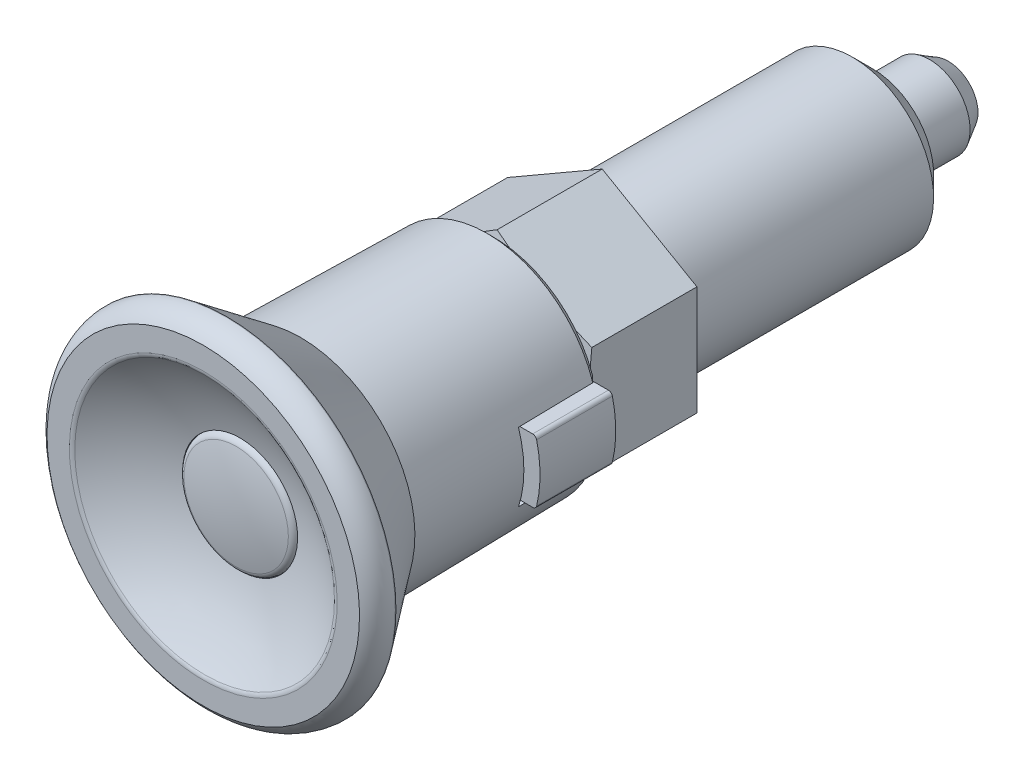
ISO-10303-21;
HEADER;
FILE_DESCRIPTION(('STEP AP214'),'2;1');
FILE_NAME('part.step','',(''),(''),'','','');
FILE_SCHEMA(('AUTOMOTIVE_DESIGN { 1 0 10303 214 1 1 1 1 }'));
ENDSEC;
DATA;
#1=APPLICATION_CONTEXT('core data for automotive mechanical design processes');
#2=APPLICATION_PROTOCOL_DEFINITION('international standard','automotive_design',2000,#1);
#3=PRODUCT_CONTEXT('',#1,'mechanical');
#4=PRODUCT('Part','Part','',(#3));
#5=PRODUCT_RELATED_PRODUCT_CATEGORY('part','',(#4));
#6=PRODUCT_DEFINITION_FORMATION('','',#4);
#7=PRODUCT_DEFINITION_CONTEXT('part definition',#1,'design');
#8=PRODUCT_DEFINITION('design','',#6,#7);
#9=PRODUCT_DEFINITION_SHAPE('','',#8);
#10=(LENGTH_UNIT() NAMED_UNIT(*) SI_UNIT(.MILLI.,.METRE.));
#11=(NAMED_UNIT(*) PLANE_ANGLE_UNIT() SI_UNIT($,.RADIAN.));
#12=(NAMED_UNIT(*) SI_UNIT($,.STERADIAN.) SOLID_ANGLE_UNIT());
#13=UNCERTAINTY_MEASURE_WITH_UNIT(LENGTH_MEASURE(1.E-05),#10,'distance_accuracy_value','');
#14=(GEOMETRIC_REPRESENTATION_CONTEXT(3) GLOBAL_UNCERTAINTY_ASSIGNED_CONTEXT((#13)) GLOBAL_UNIT_ASSIGNED_CONTEXT((#10,
#11,#12)) REPRESENTATION_CONTEXT('',''));
#15=CARTESIAN_POINT('',(0.,0.,0.));
#16=DIRECTION('',(0.,0.,1.));
#17=DIRECTION('',(1.,0.,0.));
#18=AXIS2_PLACEMENT_3D('',#15,#16,#17);
#19=CARTESIAN_POINT('',(6.,-3.05,14.1));
#20=DIRECTION('',(0.,0.,1.));
#21=DIRECTION('',(0.,-1.,0.));
#22=AXIS2_PLACEMENT_3D('',#19,#20,#21);
#23=PLANE('',#22);
#24=DIRECTION('',(0.,-1.,0.));
#25=VECTOR('',#24,1.);
#26=CARTESIAN_POINT('',(6.5,3.05,14.1));
#27=LINE('',#26,#25);
#28=CARTESIAN_POINT('',(6.5,2.55,14.1));
#29=VERTEX_POINT('',#28);
#30=CARTESIAN_POINT('',(6.5,-2.55,14.1));
#31=VERTEX_POINT('',#30);
#32=EDGE_CURVE('E165',#29,#31,#27,.T.);
#33=ORIENTED_EDGE('',*,*,#32,.F.);
#34=DIRECTION('',(-1.,0.,0.));
#35=VECTOR('',#34,1.);
#36=CARTESIAN_POINT('',(12.5,2.55,14.1));
#37=LINE('',#36,#35);
#38=CARTESIAN_POINT('',(7.90538056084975,2.55,14.1));
#39=VERTEX_POINT('',#38);
#40=EDGE_CURVE('E190',#39,#29,#37,.T.);
#41=ORIENTED_EDGE('',*,*,#40,.F.);
#42=CARTESIAN_POINT('',(0.,0.,14.1));
#43=DIRECTION('',(0.,0.,1.));
#44=DIRECTION('',(0.,-1.,0.));
#45=AXIS2_PLACEMENT_3D('',#42,#43,#44);
#46=CIRCLE('',#45,8.30647589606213);
#47=CARTESIAN_POINT('',(7.90538056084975,-2.55,14.1));
#48=VERTEX_POINT('',#47);
#49=EDGE_CURVE('E313',#48,#39,#46,.T.);
#50=ORIENTED_EDGE('',*,*,#49,.F.);
#51=DIRECTION('',(1.,0.,0.));
#52=VECTOR('',#51,1.);
#53=CARTESIAN_POINT('',(6.5,-2.55,14.1));
#54=LINE('',#53,#52);
#55=EDGE_CURVE('E188',#31,#48,#54,.T.);
#56=ORIENTED_EDGE('',*,*,#55,.F.);
#57=EDGE_LOOP('',(#33,#41,#50,#56));
#58=FACE_BOUND('',#57,.T.);
#59=ADVANCED_FACE('F14',(#58),#23,.F.);
#60=CARTESIAN_POINT('',(0.,0.,8.));
#61=DIRECTION('',(0.,0.,-1.));
#62=DIRECTION('',(0.,1.,0.));
#63=AXIS2_PLACEMENT_3D('',#60,#61,#62);
#64=PLANE('',#63);
#65=DIRECTION('',(0.,1.,0.));
#66=VECTOR('',#65,1.);
#67=CARTESIAN_POINT('',(6.5,3.05,8.));
#68=LINE('',#67,#66);
#69=CARTESIAN_POINT('',(6.5,-2.55,8.));
#70=VERTEX_POINT('',#69);
#71=CARTESIAN_POINT('',(6.5,2.55,8.));
#72=VERTEX_POINT('',#71);
#73=EDGE_CURVE('E163',#70,#72,#68,.T.);
#74=ORIENTED_EDGE('',*,*,#73,.F.);
#75=DIRECTION('',(1.,0.,0.));
#76=VECTOR('',#75,1.);
#77=CARTESIAN_POINT('',(6.5,-2.55,8.));
#78=LINE('',#77,#76);
#79=CARTESIAN_POINT('',(6.51901066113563,-2.55,8.));
#80=VERTEX_POINT('',#79);
#81=EDGE_CURVE('E177',#70,#80,#78,.T.);
#82=ORIENTED_EDGE('',*,*,#81,.T.);
#83=CARTESIAN_POINT('',(0.,0.,8.));
#84=DIRECTION('',(0.,0.,-1.));
#85=DIRECTION('',(0.,1.,0.));
#86=AXIS2_PLACEMENT_3D('',#83,#84,#85);
#87=CIRCLE('',#86,7.);
#88=CARTESIAN_POINT('',(7.,0.,8.));
#89=VERTEX_POINT('',#88);
#90=EDGE_CURVE('E192',#89,#80,#87,.T.);
#91=ORIENTED_EDGE('',*,*,#90,.F.);
#92=CARTESIAN_POINT('',(6.51901066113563,2.55,8.));
#93=VERTEX_POINT('',#92);
#94=EDGE_CURVE('E407',#93,#89,#87,.T.);
#95=ORIENTED_EDGE('',*,*,#94,.F.);
#96=DIRECTION('',(1.,0.,0.));
#97=VECTOR('',#96,1.);
#98=CARTESIAN_POINT('',(7.7,2.55,8.));
#99=LINE('',#98,#97);
#100=EDGE_CURVE('E181',#72,#93,#99,.T.);
#101=ORIENTED_EDGE('',*,*,#100,.F.);
#102=EDGE_LOOP('',(#74,#82,#91,#95,#101));
#103=FACE_BOUND('',#102,.T.);
#104=ADVANCED_FACE('F175',(#103),#64,.F.);
#105=CARTESIAN_POINT('',(5.9,-2.95,13.8));
#106=DIRECTION('',(0.,0.,1.));
#107=DIRECTION('',(0.,-1.,0.));
#108=AXIS2_PLACEMENT_3D('',#105,#106,#107);
#109=PLANE('',#108);
#110=DIRECTION('',(-1.,0.,0.));
#111=VECTOR('',#110,1.);
#112=CARTESIAN_POINT('',(8.65789109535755,2.35,13.8));
#113=LINE('',#112,#111);
#114=CARTESIAN_POINT('',(8.65789109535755,2.35,13.8));
#115=VERTEX_POINT('',#114);
#116=CARTESIAN_POINT('',(6.5,2.35,13.8));
#117=VERTEX_POINT('',#116);
#118=EDGE_CURVE('E545',#115,#117,#113,.T.);
#119=ORIENTED_EDGE('',*,*,#118,.T.);
#120=DIRECTION('',(0.,-1.,0.));
#121=VECTOR('',#120,1.);
#122=CARTESIAN_POINT('',(6.5,-2.95,13.8));
#123=LINE('',#122,#121);
#124=CARTESIAN_POINT('',(6.5,-2.35,13.8));
#125=VERTEX_POINT('',#124);
#126=EDGE_CURVE('E182',#117,#125,#123,.T.);
#127=ORIENTED_EDGE('',*,*,#126,.T.);
#128=DIRECTION('',(1.,0.,0.));
#129=VECTOR('',#128,1.);
#130=CARTESIAN_POINT('',(6.5,-2.35,13.8));
#131=LINE('',#130,#129);
#132=CARTESIAN_POINT('',(8.65789109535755,-2.35,13.8));
#133=VERTEX_POINT('',#132);
#134=EDGE_CURVE('E568',#125,#133,#131,.T.);
#135=ORIENTED_EDGE('',*,*,#134,.T.);
#136=CARTESIAN_POINT('',(8.65789109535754,-2.05,13.8));
#137=DIRECTION('',(0.,0.,1.));
#138=DIRECTION('',(1.,0.,0.));
#139=AXIS2_PLACEMENT_3D('',#136,#137,#138);
#140=CIRCLE('',#139,0.3);
#141=CARTESIAN_POINT('',(8.94963738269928,-2.11988636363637,13.8));
#142=VERTEX_POINT('',#141);
#143=EDGE_CURVE('E570',#133,#142,#140,.T.);
#144=ORIENTED_EDGE('',*,*,#143,.T.);
#145=CARTESIAN_POINT('',(0.100000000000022,0.,13.8));
#146=DIRECTION('',(0.,0.,1.));
#147=DIRECTION('',(1.,0.,0.));
#148=AXIS2_PLACEMENT_3D('',#145,#146,#147);
#149=CIRCLE('',#148,9.1);
#150=CARTESIAN_POINT('',(8.94963738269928,2.11988636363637,13.8));
#151=VERTEX_POINT('',#150);
#152=EDGE_CURVE('E572',#142,#151,#149,.T.);
#153=ORIENTED_EDGE('',*,*,#152,.T.);
#154=CARTESIAN_POINT('',(8.65789109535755,2.05,13.8));
#155=DIRECTION('',(0.,0.,1.));
#156=DIRECTION('',(1.,0.,0.));
#157=AXIS2_PLACEMENT_3D('',#154,#155,#156);
#158=CIRCLE('',#157,0.3);
#159=EDGE_CURVE('E549',#151,#115,#158,.T.);
#160=ORIENTED_EDGE('',*,*,#159,.T.);
#161=EDGE_LOOP('',(#119,#127,#135,#144,#153,#160));
#162=FACE_BOUND('',#161,.T.);
#163=ADVANCED_FACE('F277',(#162),#109,.T.);
#164=CARTESIAN_POINT('',(5.9,-2.95,8.2));
#165=DIRECTION('',(0.,0.,1.));
#166=DIRECTION('',(0.,-1.,0.));
#167=AXIS2_PLACEMENT_3D('',#164,#165,#166);
#168=PLANE('',#167);
#169=DIRECTION('',(0.,-1.,0.));
#170=VECTOR('',#169,1.);
#171=CARTESIAN_POINT('',(6.5,-2.95,8.2));
#172=LINE('',#171,#170);
#173=CARTESIAN_POINT('',(6.5,2.35,8.2));
#174=VERTEX_POINT('',#173);
#175=CARTESIAN_POINT('',(6.5,-2.35,8.2));
#176=VERTEX_POINT('',#175);
#177=EDGE_CURVE('E9',#174,#176,#172,.T.);
#178=ORIENTED_EDGE('',*,*,#177,.F.);
#179=DIRECTION('',(-1.,0.,0.));
#180=VECTOR('',#179,1.);
#181=CARTESIAN_POINT('',(8.65789109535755,2.35,8.2));
#182=LINE('',#181,#180);
#183=CARTESIAN_POINT('',(8.65789109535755,2.35,8.2));
#184=VERTEX_POINT('',#183);
#185=EDGE_CURVE('E557',#184,#174,#182,.T.);
#186=ORIENTED_EDGE('',*,*,#185,.F.);
#187=CARTESIAN_POINT('',(8.65789109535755,2.05,8.2));
#188=DIRECTION('',(0.,0.,1.));
#189=DIRECTION('',(1.,0.,0.));
#190=AXIS2_PLACEMENT_3D('',#187,#188,#189);
#191=CIRCLE('',#190,0.3);
#192=CARTESIAN_POINT('',(8.94963738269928,2.11988636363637,8.2));
#193=VERTEX_POINT('',#192);
#194=EDGE_CURVE('E578',#193,#184,#191,.T.);
#195=ORIENTED_EDGE('',*,*,#194,.F.);
#196=CARTESIAN_POINT('',(0.100000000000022,0.,8.2));
#197=DIRECTION('',(0.,0.,1.));
#198=DIRECTION('',(1.,0.,0.));
#199=AXIS2_PLACEMENT_3D('',#196,#197,#198);
#200=CIRCLE('',#199,9.1);
#201=CARTESIAN_POINT('',(8.94963738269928,-2.11988636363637,8.2));
#202=VERTEX_POINT('',#201);
#203=EDGE_CURVE('E576',#202,#193,#200,.T.);
#204=ORIENTED_EDGE('',*,*,#203,.F.);
#205=CARTESIAN_POINT('',(8.65789109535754,-2.05,8.2));
#206=DIRECTION('',(0.,0.,1.));
#207=DIRECTION('',(1.,0.,0.));
#208=AXIS2_PLACEMENT_3D('',#205,#206,#207);
#209=CIRCLE('',#208,0.3);
#210=CARTESIAN_POINT('',(8.65789109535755,-2.35,8.2));
#211=VERTEX_POINT('',#210);
#212=EDGE_CURVE('E565',#211,#202,#209,.T.);
#213=ORIENTED_EDGE('',*,*,#212,.F.);
#214=DIRECTION('',(1.,0.,0.));
#215=VECTOR('',#214,1.);
#216=CARTESIAN_POINT('',(6.5,-2.35,8.2));
#217=LINE('',#216,#215);
#218=EDGE_CURVE('E563',#176,#211,#217,.T.);
#219=ORIENTED_EDGE('',*,*,#218,.F.);
#220=EDGE_LOOP('',(#178,#186,#195,#204,#213,#219));
#221=FACE_BOUND('',#220,.T.);
#222=ADVANCED_FACE('F535',(#221),#168,.F.);
#223=CARTESIAN_POINT('',(0.,0.,42.2));
#224=DIRECTION('',(0.,0.,-1.));
#225=DIRECTION('',(-1.,0.,0.));
#226=AXIS2_PLACEMENT_3D('',#223,#224,#225);
#227=SPHERICAL_SURFACE('',#226,16.);
#228=CARTESIAN_POINT('',(0.,0.,29.4));
#229=DIRECTION('',(0.,0.,-1.));
#230=DIRECTION('',(0.,1.,0.));
#231=AXIS2_PLACEMENT_3D('',#228,#229,#230);
#232=CIRCLE('',#231,9.6);
#233=CARTESIAN_POINT('',(-9.59999999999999,0.,29.4));
#234=VERTEX_POINT('',#233);
#235=EDGE_CURVE('E309',#234,#234,#232,.T.);
#236=CARTESIAN_POINT('',(0.,0.,26.7747771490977));
#237=DIRECTION('',(0.,0.,1.));
#238=DIRECTION('',(0.,-1.,0.));
#239=AXIS2_PLACEMENT_3D('',#236,#237,#238);
#240=CIRCLE('',#239,4.25);
#241=CARTESIAN_POINT('',(-4.24999999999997,0.,26.7747771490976));
#242=VERTEX_POINT('',#241);
#243=EDGE_CURVE('E607',#242,#242,#240,.T.);
#244=CARTESIAN_POINT('',(-9.59999999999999,0.,29.4));
#245=CARTESIAN_POINT('',(-9.55004681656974,0.,29.3625350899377));
#246=CARTESIAN_POINT('',(-9.49987429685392,0.,29.3253626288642));
#247=CARTESIAN_POINT('',(-9.39909750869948,0.,29.2516076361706));
#248=CARTESIAN_POINT('',(-9.34849324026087,0.,29.2150251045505));
#249=CARTESIAN_POINT('',(-9.24685987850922,0.,29.1424550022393));
#250=CARTESIAN_POINT('',(-9.19583078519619,0.,29.1064674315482));
#251=CARTESIAN_POINT('',(-9.09335477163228,0.,29.0350921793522));
#252=CARTESIAN_POINT('',(-9.0419078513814,0.,28.9997044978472));
#253=CARTESIAN_POINT('',(-8.93860323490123,0.,28.929533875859));
#254=CARTESIAN_POINT('',(-8.88674553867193,0.,28.8947509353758));
#255=CARTESIAN_POINT('',(-8.78262647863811,0.,28.8257945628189));
#256=CARTESIAN_POINT('',(-8.73036511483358,0.,28.7916211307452));
#257=CARTESIAN_POINT('',(-8.62544588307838,0.,28.7238884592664));
#258=CARTESIAN_POINT('',(-8.5727880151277,0.,28.6903292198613));
#259=CARTESIAN_POINT('',(-8.46708299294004,0.,28.6238295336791));
#260=CARTESIAN_POINT('',(-8.41403583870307,0.,28.5908890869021));
#261=CARTESIAN_POINT('',(-8.30755951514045,0.,28.5256315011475));
#262=CARTESIAN_POINT('',(-8.2541303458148,0.,28.4933143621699));
#263=CARTESIAN_POINT('',(-8.14689731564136,0.,28.4293078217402));
#264=CARTESIAN_POINT('',(-8.09309345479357,0.,28.3976184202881));
#265=CARTESIAN_POINT('',(-7.98511841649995,0.,28.3348716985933));
#266=CARTESIAN_POINT('',(-7.93094723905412,0.,28.3038143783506));
#267=CARTESIAN_POINT('',(-7.82224499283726,0.,28.2423360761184));
#268=CARTESIAN_POINT('',(-7.76771392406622,0.,28.2119150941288));
#269=CARTESIAN_POINT('',(-7.65829936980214,0.,28.1517136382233));
#270=CARTESIAN_POINT('',(-7.6034158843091,0.,28.1219331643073));
#271=CARTESIAN_POINT('',(-7.49330401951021,0.,28.0630168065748));
#272=CARTESIAN_POINT('',(-7.43807564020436,0.,28.0338809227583));
#273=CARTESIAN_POINT('',(-7.32728155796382,0.,27.9762577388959));
#274=CARTESIAN_POINT('',(-7.27171585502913,0.,27.9477704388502));
#275=CARTESIAN_POINT('',(-7.16025474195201,0.,27.8914483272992));
#276=CARTESIAN_POINT('',(-7.10435933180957,0.,27.863613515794));
#277=CARTESIAN_POINT('',(-6.9922464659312,0.,27.8086001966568));
#278=CARTESIAN_POINT('',(-6.93602901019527,0.,27.7814216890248));
#279=CARTESIAN_POINT('',(-6.82327975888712,0.,27.7277247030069));
#280=CARTESIAN_POINT('',(-6.76674796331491,0.,27.701206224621));
#281=CARTESIAN_POINT('',(-6.65337778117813,0.,27.6488329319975));
#282=CARTESIAN_POINT('',(-6.59653939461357,0.,27.6229781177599));
#283=CARTESIAN_POINT('',(-6.48256382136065,0.,27.5719356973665));
#284=CARTESIAN_POINT('',(-6.42542663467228,0.,27.5467480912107));
#285=CARTESIAN_POINT('',(-6.31086129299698,0.,27.4970435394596));
#286=CARTESIAN_POINT('',(-6.25343313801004,0.,27.4725265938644));
#287=CARTESIAN_POINT('',(-6.13829373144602,0.,27.4241667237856));
#288=CARTESIAN_POINT('',(-6.08058247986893,0.,27.400323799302));
#289=CARTESIAN_POINT('',(-5.96488479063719,0.,27.3533152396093));
#290=CARTESIAN_POINT('',(-5.90689835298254,0.,27.3301496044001));
#291=CARTESIAN_POINT('',(-5.79065823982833,0.,27.2844987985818));
#292=CARTESIAN_POINT('',(-5.73240456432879,0.,27.2620136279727));
#293=CARTESIAN_POINT('',(-5.61563796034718,0.,27.2177268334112));
#294=CARTESIAN_POINT('',(-5.55712503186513,0.,27.1959252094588));
#295=CARTESIAN_POINT('',(-5.43984794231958,0.,27.1530084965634));
#296=CARTESIAN_POINT('',(-5.38108378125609,0.,27.1318934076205));
#297=CARTESIAN_POINT('',(-5.26331228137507,0.,27.0903526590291));
#298=CARTESIAN_POINT('',(-5.20430494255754,0.,27.0699269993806));
#299=CARTESIAN_POINT('',(-5.08605517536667,0.,27.0297679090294));
#300=CARTESIAN_POINT('',(-5.02681274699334,0.,27.0100344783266));
#301=CARTESIAN_POINT('',(-4.9081009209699,0.,26.9712625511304));
#302=CARTESIAN_POINT('',(-4.84863152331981,0.,26.952224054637));
#303=CARTESIAN_POINT('',(-4.72947391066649,0.,26.9148446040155));
#304=CARTESIAN_POINT('',(-4.66978569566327,0.,26.8965036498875));
#305=CARTESIAN_POINT('',(-4.55019862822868,0.,26.8605218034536));
#306=CARTESIAN_POINT('',(-4.4902997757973,0.,26.8428809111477));
#307=CARTESIAN_POINT('',(-4.37029964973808,0.,26.8083015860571));
#308=CARTESIAN_POINT('',(-4.31019837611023,0.,26.7913631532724));
#309=CARTESIAN_POINT('',(-4.24999999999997,0.,26.7747771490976));
#310=B_SPLINE_CURVE_WITH_KNOTS('',3,(#244,#245,#246,#247,#248,#249,#250,#251,#252,#253,#254,
#255,#256,#257,#258,#259,#260,#261,#262,#263,#264,#265,#266,#267,#268,#269,#270,#271,#272,#273,
#274,#275,#276,#277,#278,#279,#280,#281,#282,#283,#284,#285,#286,#287,#288,#289,#290,#291,#292,
#293,#294,#295,#296,#297,#298,#299,#300,#301,#302,#303,#304,#305,#306,#307,#308,#309),
.UNSPECIFIED.,.F.,.F.,(4,2,2,2,2,2,2,2,2,2,2,2,2,2,2,2,2,2,2,2,2,2,2,2,2,2,2,2,2,2,2,2,4),(0.,
0.187323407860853,0.374646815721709,0.561970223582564,0.749293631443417,0.936617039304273,
1.12394044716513,1.31126385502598,1.49858726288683,1.68591067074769,1.87323407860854,
2.06055748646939,2.24788089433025,2.4352043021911,2.62252771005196,2.80985111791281,
2.99717452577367,3.18449793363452,3.37182134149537,3.55914474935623,3.74646815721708,
3.93379156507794,4.12111497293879,4.30843838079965,4.4957617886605,4.68308519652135,
4.87040860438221,5.05773201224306,5.24505542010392,5.43237882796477,5.61970223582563,
5.80702564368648,5.99434905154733),.UNSPECIFIED.);
#311=EDGE_CURVE('BSEAM16',#234,#242,#310,.T.);
#312=ORIENTED_EDGE('',*,*,#235,.F.);
#313=ORIENTED_EDGE('',*,*,#243,.F.);
#314=ORIENTED_EDGE('',*,*,#311,.T.);
#315=ORIENTED_EDGE('',*,*,#311,.F.);
#316=EDGE_LOOP('',(#312,#314,#313,#315));
#317=FACE_BOUND('',#316,.T.);
#318=ADVANCED_FACE('F16',(#317),#227,.F.);
#319=CARTESIAN_POINT('',(0.,0.,8.));
#320=DIRECTION('',(0.,0.,-1.));
#321=DIRECTION('',(0.,1.,0.));
#322=AXIS2_PLACEMENT_3D('',#319,#320,#321);
#323=CONICAL_SURFACE('',#322,7.,1.36135681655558);
#324=CARTESIAN_POINT('',(-7.,10.7246868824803,6.76568687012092));
#325=CARTESIAN_POINT('',(-7.,10.4064912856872,6.82230985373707));
#326=CARTESIAN_POINT('',(-7.,10.0881685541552,6.87823096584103));
#327=CARTESIAN_POINT('',(-7.,9.45120727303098,6.98829532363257));
#328=CARTESIAN_POINT('',(-7.,9.13256871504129,7.04243852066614));
#329=CARTESIAN_POINT('',(-7.,8.49473869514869,7.14860189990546));
#330=CARTESIAN_POINT('',(-7.,8.17554701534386,7.20062077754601));
#331=CARTESIAN_POINT('',(-7.,7.53674183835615,7.30199906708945));
#332=CARTESIAN_POINT('',(-7.,7.21712834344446,7.35135849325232));
#333=CARTESIAN_POINT('',(-7.,6.57898608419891,7.44655981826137));
#334=CARTESIAN_POINT('',(-7.,6.26045973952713,7.49241785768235));
#335=CARTESIAN_POINT('',(-7.,5.62285588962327,7.58012018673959));
#336=CARTESIAN_POINT('',(-7.,5.30377839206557,7.62196453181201));
#337=CARTESIAN_POINT('',(-7.,4.66503306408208,7.70071520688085));
#338=CARTESIAN_POINT('',(-7.,4.3453652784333,7.73762189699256));
#339=CARTESIAN_POINT('',(-7.,3.70538679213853,7.8054334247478));
#340=CARTESIAN_POINT('',(-7.,3.38507609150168,7.83633826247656));
#341=CARTESIAN_POINT('',(-7.,2.74159734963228,7.89118786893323));
#342=CARTESIAN_POINT('',(-7.,2.41842497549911,7.91508252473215));
#343=CARTESIAN_POINT('',(-7.,1.77156570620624,7.95450210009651));
#344=CARTESIAN_POINT('',(-7.,1.44787881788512,7.97002712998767));
#345=CARTESIAN_POINT('',(-7.,0.800279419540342,7.99184898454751));
#346=CARTESIAN_POINT('',(-7.,0.476366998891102,7.99814841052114));
#347=CARTESIAN_POINT('',(-7.,-0.171502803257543,8.00114612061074));
#348=CARTESIAN_POINT('',(-7.,-0.495460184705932,7.99784441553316));
#349=CARTESIAN_POINT('',(-7.,-1.14388714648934,7.98182372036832));
#350=CARTESIAN_POINT('',(-7.,-1.46835617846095,7.96908296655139));
#351=CARTESIAN_POINT('',(-7.,-2.11683072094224,7.93489102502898));
#352=CARTESIAN_POINT('',(-7.,-2.44083622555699,7.91343972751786));
#353=CARTESIAN_POINT('',(-7.,-3.08836885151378,7.86288436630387));
#354=CARTESIAN_POINT('',(-7.,-3.4118957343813,7.83377729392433));
#355=CARTESIAN_POINT('',(-7.,-4.05829550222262,7.76909784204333));
#356=CARTESIAN_POINT('',(-7.,-4.38116838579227,7.73352544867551));
#357=CARTESIAN_POINT('',(-7.,-5.01341477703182,7.65857236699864));
#358=CARTESIAN_POINT('',(-7.,-5.32281323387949,7.61940007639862));
#359=CARTESIAN_POINT('',(-7.,-5.94107527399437,7.53702075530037));
#360=CARTESIAN_POINT('',(-7.,-6.24993884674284,7.49381364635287));
#361=CARTESIAN_POINT('',(-7.,-6.86720551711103,7.40410688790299));
#362=CARTESIAN_POINT('',(-7.,-7.1756085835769,7.35760702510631));
#363=CARTESIAN_POINT('',(-7.,-7.79199857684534,7.26191983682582));
#364=CARTESIAN_POINT('',(-7.,-8.09998549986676,7.21273248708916));
#365=CARTESIAN_POINT('',(-7.,-9.02353606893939,7.0618803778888));
#366=CARTESIAN_POINT('',(-7.,-9.63856472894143,6.9569441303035));
#367=CARTESIAN_POINT('',(-7.,-10.8675517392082,6.74118852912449));
#368=CARTESIAN_POINT('',(-7.,-11.4815101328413,6.63036941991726));
#369=CARTESIAN_POINT('',(-7.,-12.7047863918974,6.40532430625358));
#370=CARTESIAN_POINT('',(-7.,-13.3141090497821,6.29112427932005));
#371=CARTESIAN_POINT('',(-7.,-14.5322048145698,6.05979683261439));
#372=CARTESIAN_POINT('',(-7.,-15.1409779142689,5.94266937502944));
#373=CARTESIAN_POINT('',(-7.,-16.3575553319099,5.70636965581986));
#374=CARTESIAN_POINT('',(-7.,-16.9653600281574,5.58719933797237));
#375=CARTESIAN_POINT('',(-7.,-18.180629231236,5.34720792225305));
#376=CARTESIAN_POINT('',(-7.,-18.788093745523,5.2263868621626));
#377=CARTESIAN_POINT('',(-7.,-19.3954409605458,5.10498617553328));
#378=B_SPLINE_CURVE_WITH_KNOTS('',3,(#324,#325,#326,#327,#328,#329,#330,#331,#332,#333,#334,
#335,#336,#337,#338,#339,#340,#341,#342,#343,#344,#345,#346,#347,#348,#349,#350,#351,#352,#353,
#354,#355,#356,#357,#358,#359,#360,#361,#362,#363,#364,#365,#366,#367,#368,#369,#370,#371,#372,
#373,#374,#375,#376,#377),.UNSPECIFIED.,.F.,.F.,(4,2,2,2,2,2,2,2,2,2,2,2,2,2,2,2,2,2,2,2,2,2,2,
2,2,2,4),(0.,0.969585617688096,1.93919774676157,2.90939663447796,3.87959031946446,
4.84500132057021,5.81039898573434,6.77572620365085,7.74105340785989,8.7131219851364,
9.68517774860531,10.6569593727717,11.6287399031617,12.6027680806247,13.5768085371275,
14.5512323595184,15.5256582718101,16.4612316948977,17.3968233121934,18.3324755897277,
19.268136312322,21.1398361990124,23.011458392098,24.8712443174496,26.7310542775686,
28.5891833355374,30.4472699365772),.UNSPECIFIED.);
#379=CARTESIAN_POINT('',(-7.,-4.04145188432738,7.76982169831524));
#380=VERTEX_POINT('',#379);
#381=CARTESIAN_POINT('',(-7.,0.,8.));
#382=VERTEX_POINT('',#381);
#383=EDGE_CURVE('E479',#380,#382,#378,.F.);
#384=ORIENTED_EDGE('',*,*,#383,.F.);
#385=CARTESIAN_POINT('',(0.000200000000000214,-8.0830192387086,7.76979715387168));
#386=CARTESIAN_POINT('',(-0.290867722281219,-7.91497121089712,7.80553258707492));
#387=CARTESIAN_POINT('',(-0.582269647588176,-7.74673023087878,7.83794528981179));
#388=CARTESIAN_POINT('',(-1.16572171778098,-7.40987402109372,7.89485664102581));
#389=CARTESIAN_POINT('',(-1.4577720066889,-7.24125870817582,7.91935330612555));
#390=CARTESIAN_POINT('',(-2.04140258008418,-6.90429943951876,7.95908000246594));
#391=CARTESIAN_POINT('',(-2.33298129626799,-6.73595638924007,7.97433996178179));
#392=CARTESIAN_POINT('',(-2.91637336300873,-6.39913482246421,7.99479936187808));
#393=CARTESIAN_POINT('',(-3.20818668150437,-6.23065632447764,8.));
#394=CARTESIAN_POINT('',(-3.79181331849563,-5.8936993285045,8.));
#395=CARTESIAN_POINT('',(-4.08362663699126,-5.72522083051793,7.99479936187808));
#396=CARTESIAN_POINT('',(-4.667018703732,-5.38839926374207,7.97433996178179));
#397=CARTESIAN_POINT('',(-4.95859741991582,-5.22005621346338,7.95908000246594));
#398=CARTESIAN_POINT('',(-5.5422279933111,-4.88309694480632,7.91935330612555));
#399=CARTESIAN_POINT('',(-5.83427828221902,-4.71448163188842,7.89485664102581));
#400=CARTESIAN_POINT('',(-6.41773035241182,-4.37762542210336,7.83794528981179));
#401=CARTESIAN_POINT('',(-6.70913227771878,-4.20938444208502,7.80553258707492));
#402=CARTESIAN_POINT('',(-7.0002,-4.04133641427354,7.76979715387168));
#403=B_SPLINE_CURVE_WITH_KNOTS('',3,(#385,#386,#387,#388,#389,#390,#391,#392,#393,#394,#395,
#396,#397,#398,#399,#400,#401,#402),.UNSPECIFIED.,.F.,.F.,(4,2,2,2,2,2,2,2,4),(0.,
1.01400391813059,2.02826170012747,3.03921531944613,4.05004859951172,5.06088187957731,
6.07183549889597,7.08609328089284,8.10009719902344),.UNSPECIFIED.);
#404=CARTESIAN_POINT('',(-3.5,-6.06217782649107,8.));
#405=VERTEX_POINT('',#404);
#406=EDGE_CURVE('E353',#405,#380,#403,.T.);
#407=ORIENTED_EDGE('',*,*,#406,.F.);
#408=EDGE_CURVE('E429',#405,#382,#87,.T.);
#409=ORIENTED_EDGE('',*,*,#408,.T.);
#410=EDGE_LOOP('',(#384,#407,#409));
#411=FACE_BOUND('',#410,.T.);
#412=ADVANCED_FACE('F373',(#411),#323,.T.);
#413=CARTESIAN_POINT('',(-7.,4.04145188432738,7.76982169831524));
#414=VERTEX_POINT('',#413);
#415=EDGE_CURVE('E483',#382,#414,#378,.F.);
#416=ORIENTED_EDGE('',*,*,#415,.F.);
#417=CARTESIAN_POINT('',(-3.5,6.06217782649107,8.));
#418=VERTEX_POINT('',#417);
#419=EDGE_CURVE('E423',#382,#418,#87,.T.);
#420=ORIENTED_EDGE('',*,*,#419,.T.);
#421=CARTESIAN_POINT('',(-7.0002,4.04133641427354,7.76979715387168));
#422=CARTESIAN_POINT('',(-6.70913227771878,4.20938444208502,7.80553258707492));
#423=CARTESIAN_POINT('',(-6.41773035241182,4.37762542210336,7.83794528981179));
#424=CARTESIAN_POINT('',(-5.83427828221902,4.71448163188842,7.89485664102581));
#425=CARTESIAN_POINT('',(-5.5422279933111,4.88309694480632,7.91935330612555));
#426=CARTESIAN_POINT('',(-4.95859741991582,5.22005621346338,7.95908000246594));
#427=CARTESIAN_POINT('',(-4.667018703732,5.38839926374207,7.97433996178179));
#428=CARTESIAN_POINT('',(-4.08362663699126,5.72522083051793,7.99479936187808));
#429=CARTESIAN_POINT('',(-3.79181331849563,5.8936993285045,8.));
#430=CARTESIAN_POINT('',(-3.20818668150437,6.23065632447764,8.));
#431=CARTESIAN_POINT('',(-2.91637336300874,6.39913482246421,7.99479936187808));
#432=CARTESIAN_POINT('',(-2.33298129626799,6.73595638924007,7.97433996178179));
#433=CARTESIAN_POINT('',(-2.04140258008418,6.90429943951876,7.95908000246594));
#434=CARTESIAN_POINT('',(-1.4577720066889,7.24125870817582,7.91935330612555));
#435=CARTESIAN_POINT('',(-1.16572171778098,7.40987402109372,7.89485664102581));
#436=CARTESIAN_POINT('',(-0.582269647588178,7.74673023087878,7.83794528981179));
#437=CARTESIAN_POINT('',(-0.290867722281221,7.91497121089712,7.80553258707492));
#438=CARTESIAN_POINT('',(0.000199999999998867,8.0830192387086,7.76979715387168));
#439=B_SPLINE_CURVE_WITH_KNOTS('',3,(#421,#422,#423,#424,#425,#426,#427,#428,#429,#430,#431,
#432,#433,#434,#435,#436,#437,#438),.UNSPECIFIED.,.F.,.F.,(4,2,2,2,2,2,2,2,4),(0.,
1.01400391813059,2.02826170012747,3.03921531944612,4.05004859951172,5.06088187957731,
6.07183549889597,7.08609328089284,8.10009719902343),.UNSPECIFIED.);
#440=EDGE_CURVE('E436',#414,#418,#439,.T.);
#441=ORIENTED_EDGE('',*,*,#440,.F.);
#442=EDGE_LOOP('',(#416,#420,#441));
#443=FACE_BOUND('',#442,.T.);
#444=ADVANCED_FACE('F486',(#443),#323,.T.);
#445=CARTESIAN_POINT('',(0.,8.08290376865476,7.76982169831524));
#446=VERTEX_POINT('',#445);
#447=EDGE_CURVE('E434',#418,#446,#439,.T.);
#448=ORIENTED_EDGE('',*,*,#447,.F.);
#449=CARTESIAN_POINT('',(3.5,6.06217782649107,8.));
#450=VERTEX_POINT('',#449);
#451=EDGE_CURVE('E419',#418,#450,#87,.T.);
#452=ORIENTED_EDGE('',*,*,#451,.T.);
#453=CARTESIAN_POINT('',(-0.000200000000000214,8.0830192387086,7.76979715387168));
#454=CARTESIAN_POINT('',(0.290867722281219,7.91497121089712,7.80553258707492));
#455=CARTESIAN_POINT('',(0.582269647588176,7.74673023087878,7.83794528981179));
#456=CARTESIAN_POINT('',(1.16572171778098,7.40987402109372,7.89485664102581));
#457=CARTESIAN_POINT('',(1.4577720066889,7.24125870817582,7.91935330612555));
#458=CARTESIAN_POINT('',(2.04140258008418,6.90429943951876,7.95908000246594));
#459=CARTESIAN_POINT('',(2.33298129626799,6.73595638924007,7.97433996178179));
#460=CARTESIAN_POINT('',(2.91637336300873,6.39913482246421,7.99479936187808));
#461=CARTESIAN_POINT('',(3.20818668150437,6.23065632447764,8.));
#462=CARTESIAN_POINT('',(3.79181331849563,5.8936993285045,8.));
#463=CARTESIAN_POINT('',(4.08362663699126,5.72522083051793,7.99479936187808));
#464=CARTESIAN_POINT('',(4.667018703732,5.38839926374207,7.97433996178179));
#465=CARTESIAN_POINT('',(4.95859741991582,5.22005621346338,7.95908000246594));
#466=CARTESIAN_POINT('',(5.5422279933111,4.88309694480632,7.91935330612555));
#467=CARTESIAN_POINT('',(5.83427828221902,4.71448163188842,7.89485664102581));
#468=CARTESIAN_POINT('',(6.41773035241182,4.37762542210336,7.83794528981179));
#469=CARTESIAN_POINT('',(6.70913227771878,4.20938444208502,7.80553258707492));
#470=CARTESIAN_POINT('',(7.0002,4.04133641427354,7.76979715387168));
#471=B_SPLINE_CURVE_WITH_KNOTS('',3,(#453,#454,#455,#456,#457,#458,#459,#460,#461,#462,#463,
#464,#465,#466,#467,#468,#469,#470),.UNSPECIFIED.,.F.,.F.,(4,2,2,2,2,2,2,2,4),(0.,
1.01400391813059,2.02826170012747,3.03921531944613,4.05004859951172,5.06088187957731,
6.07183549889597,7.08609328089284,8.10009719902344),.UNSPECIFIED.);
#472=EDGE_CURVE('E433',#446,#450,#471,.T.);
#473=ORIENTED_EDGE('',*,*,#472,.F.);
#474=EDGE_LOOP('',(#448,#452,#473));
#475=FACE_BOUND('',#474,.T.);
#476=ADVANCED_FACE('F621',(#475),#323,.T.);
#477=CARTESIAN_POINT('',(7.,4.04145188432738,7.76982169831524));
#478=VERTEX_POINT('',#477);
#479=EDGE_CURVE('E335',#450,#478,#471,.T.);
#480=ORIENTED_EDGE('',*,*,#479,.F.);
#481=EDGE_CURVE('E411',#450,#93,#87,.T.);
#482=ORIENTED_EDGE('',*,*,#481,.T.);
#483=ORIENTED_EDGE('',*,*,#94,.T.);
#484=CARTESIAN_POINT('',(7.,10.7246868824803,6.76568687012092));
#485=CARTESIAN_POINT('',(7.,10.4064912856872,6.82230985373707));
#486=CARTESIAN_POINT('',(7.,10.0881685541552,6.87823096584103));
#487=CARTESIAN_POINT('',(7.,9.45120727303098,6.98829532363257));
#488=CARTESIAN_POINT('',(7.,9.13256871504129,7.04243852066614));
#489=CARTESIAN_POINT('',(7.,8.49473869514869,7.14860189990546));
#490=CARTESIAN_POINT('',(7.,8.17554701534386,7.20062077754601));
#491=CARTESIAN_POINT('',(7.,7.53674183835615,7.30199906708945));
#492=CARTESIAN_POINT('',(7.,7.21712834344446,7.35135849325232));
#493=CARTESIAN_POINT('',(7.,6.57898608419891,7.44655981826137));
#494=CARTESIAN_POINT('',(7.,6.26045973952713,7.49241785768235));
#495=CARTESIAN_POINT('',(7.,5.62285588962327,7.58012018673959));
#496=CARTESIAN_POINT('',(7.,5.30377839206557,7.62196453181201));
#497=CARTESIAN_POINT('',(7.,4.66503306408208,7.70071520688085));
#498=CARTESIAN_POINT('',(7.,4.3453652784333,7.73762189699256));
#499=CARTESIAN_POINT('',(7.,3.70538679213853,7.8054334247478));
#500=CARTESIAN_POINT('',(7.,3.38507609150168,7.83633826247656));
#501=CARTESIAN_POINT('',(7.,2.74159734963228,7.89118786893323));
#502=CARTESIAN_POINT('',(7.,2.41842497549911,7.91508252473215));
#503=CARTESIAN_POINT('',(7.,1.77156570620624,7.95450210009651));
#504=CARTESIAN_POINT('',(7.,1.44787881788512,7.97002712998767));
#505=CARTESIAN_POINT('',(7.,0.800279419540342,7.99184898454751));
#506=CARTESIAN_POINT('',(7.,0.476366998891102,7.99814841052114));
#507=CARTESIAN_POINT('',(7.,-0.171502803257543,8.00114612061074));
#508=CARTESIAN_POINT('',(7.,-0.495460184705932,7.99784441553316));
#509=CARTESIAN_POINT('',(7.,-1.14388714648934,7.98182372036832));
#510=CARTESIAN_POINT('',(7.,-1.46835617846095,7.96908296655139));
#511=CARTESIAN_POINT('',(7.,-2.11683072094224,7.93489102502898));
#512=CARTESIAN_POINT('',(7.,-2.44083622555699,7.91343972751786));
#513=CARTESIAN_POINT('',(7.,-3.08836885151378,7.86288436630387));
#514=CARTESIAN_POINT('',(7.,-3.4118957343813,7.83377729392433));
#515=CARTESIAN_POINT('',(7.,-4.05829550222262,7.76909784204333));
#516=CARTESIAN_POINT('',(7.,-4.38116838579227,7.73352544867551));
#517=CARTESIAN_POINT('',(7.,-5.01341477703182,7.65857236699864));
#518=CARTESIAN_POINT('',(7.,-5.32281323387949,7.61940007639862));
#519=CARTESIAN_POINT('',(7.,-5.94107527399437,7.53702075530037));
#520=CARTESIAN_POINT('',(7.,-6.24993884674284,7.49381364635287));
#521=CARTESIAN_POINT('',(7.,-6.86720551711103,7.40410688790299));
#522=CARTESIAN_POINT('',(7.,-7.1756085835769,7.35760702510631));
#523=CARTESIAN_POINT('',(7.,-7.79199857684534,7.26191983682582));
#524=CARTESIAN_POINT('',(7.,-8.09998549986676,7.21273248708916));
#525=CARTESIAN_POINT('',(7.,-9.02353606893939,7.0618803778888));
#526=CARTESIAN_POINT('',(7.,-9.63856472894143,6.9569441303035));
#527=CARTESIAN_POINT('',(7.,-10.8675517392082,6.74118852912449));
#528=CARTESIAN_POINT('',(7.,-11.4815101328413,6.63036941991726));
#529=CARTESIAN_POINT('',(7.,-12.7047863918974,6.40532430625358));
#530=CARTESIAN_POINT('',(7.,-13.3141090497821,6.29112427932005));
#531=CARTESIAN_POINT('',(7.,-14.5322048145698,6.05979683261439));
#532=CARTESIAN_POINT('',(7.,-15.1409779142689,5.94266937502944));
#533=CARTESIAN_POINT('',(7.,-16.3575553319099,5.70636965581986));
#534=CARTESIAN_POINT('',(7.,-16.9653600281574,5.58719933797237));
#535=CARTESIAN_POINT('',(7.,-18.180629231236,5.34720792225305));
#536=CARTESIAN_POINT('',(7.,-18.788093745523,5.2263868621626));
#537=CARTESIAN_POINT('',(7.,-19.3954409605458,5.10498617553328));
#538=B_SPLINE_CURVE_WITH_KNOTS('',3,(#484,#485,#486,#487,#488,#489,#490,#491,#492,#493,#494,
#495,#496,#497,#498,#499,#500,#501,#502,#503,#504,#505,#506,#507,#508,#509,#510,#511,#512,#513,
#514,#515,#516,#517,#518,#519,#520,#521,#522,#523,#524,#525,#526,#527,#528,#529,#530,#531,#532,
#533,#534,#535,#536,#537),.UNSPECIFIED.,.F.,.F.,(4,2,2,2,2,2,2,2,2,2,2,2,2,2,2,2,2,2,2,2,2,2,2,
2,2,2,4),(0.,0.969585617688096,1.93919774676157,2.90939663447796,3.87959031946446,
4.84500132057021,5.81039898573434,6.77572620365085,7.74105340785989,8.7131219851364,
9.68517774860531,10.6569593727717,11.6287399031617,12.6027680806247,13.5768085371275,
14.5512323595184,15.5256582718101,16.4612316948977,17.3968233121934,18.3324755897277,
19.268136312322,21.1398361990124,23.011458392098,24.8712443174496,26.7310542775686,
28.5891833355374,30.4472699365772),.UNSPECIFIED.);
#539=EDGE_CURVE('E438',#478,#89,#538,.T.);
#540=ORIENTED_EDGE('',*,*,#539,.F.);
#541=EDGE_LOOP('',(#480,#482,#483,#540));
#542=FACE_BOUND('',#541,.T.);
#543=ADVANCED_FACE('F431',(#542),#323,.T.);
#544=CARTESIAN_POINT('',(7.,-4.04145188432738,7.76982169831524));
#545=VERTEX_POINT('',#544);
#546=EDGE_CURVE('E444',#89,#545,#538,.T.);
#547=ORIENTED_EDGE('',*,*,#546,.F.);
#548=ORIENTED_EDGE('',*,*,#90,.T.);
#549=CARTESIAN_POINT('',(3.5,-6.06217782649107,8.));
#550=VERTEX_POINT('',#549);
#551=EDGE_CURVE('E418',#80,#550,#87,.T.);
#552=ORIENTED_EDGE('',*,*,#551,.T.);
#553=CARTESIAN_POINT('',(7.0002,-4.04133641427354,7.76979715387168));
#554=CARTESIAN_POINT('',(6.70913227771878,-4.20938444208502,7.80553258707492));
#555=CARTESIAN_POINT('',(6.41773035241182,-4.37762542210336,7.83794528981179));
#556=CARTESIAN_POINT('',(5.83427828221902,-4.71448163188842,7.89485664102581));
#557=CARTESIAN_POINT('',(5.5422279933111,-4.88309694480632,7.91935330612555));
#558=CARTESIAN_POINT('',(4.95859741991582,-5.22005621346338,7.95908000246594));
#559=CARTESIAN_POINT('',(4.667018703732,-5.38839926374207,7.97433996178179));
#560=CARTESIAN_POINT('',(4.08362663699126,-5.72522083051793,7.99479936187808));
#561=CARTESIAN_POINT('',(3.79181331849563,-5.8936993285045,8.));
#562=CARTESIAN_POINT('',(3.20818668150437,-6.23065632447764,8.));
#563=CARTESIAN_POINT('',(2.91637336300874,-6.39913482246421,7.99479936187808));
#564=CARTESIAN_POINT('',(2.33298129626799,-6.73595638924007,7.97433996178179));
#565=CARTESIAN_POINT('',(2.04140258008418,-6.90429943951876,7.95908000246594));
#566=CARTESIAN_POINT('',(1.4577720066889,-7.24125870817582,7.91935330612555));
#567=CARTESIAN_POINT('',(1.16572171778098,-7.40987402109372,7.89485664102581));
#568=CARTESIAN_POINT('',(0.582269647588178,-7.74673023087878,7.83794528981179));
#569=CARTESIAN_POINT('',(0.290867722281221,-7.91497121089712,7.80553258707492));
#570=CARTESIAN_POINT('',(-0.000199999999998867,-8.0830192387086,7.76979715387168));
#571=B_SPLINE_CURVE_WITH_KNOTS('',3,(#553,#554,#555,#556,#557,#558,#559,#560,#561,#562,#563,
#564,#565,#566,#567,#568,#569,#570),.UNSPECIFIED.,.F.,.F.,(4,2,2,2,2,2,2,2,4),(0.,
1.01400391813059,2.02826170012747,3.03921531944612,4.05004859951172,5.06088187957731,
6.07183549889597,7.08609328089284,8.10009719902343),.UNSPECIFIED.);
#572=EDGE_CURVE('E470',#545,#550,#571,.T.);
#573=ORIENTED_EDGE('',*,*,#572,.F.);
#574=EDGE_LOOP('',(#547,#548,#552,#573));
#575=FACE_BOUND('',#574,.T.);
#576=ADVANCED_FACE('F623',(#575),#323,.T.);
#577=CARTESIAN_POINT('',(0.,-8.08290376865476,7.76982169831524));
#578=VERTEX_POINT('',#577);
#579=EDGE_CURVE('E366',#550,#578,#571,.T.);
#580=ORIENTED_EDGE('',*,*,#579,.F.);
#581=EDGE_CURVE('E413',#550,#405,#87,.T.);
#582=ORIENTED_EDGE('',*,*,#581,.T.);
#583=EDGE_CURVE('E29',#578,#405,#403,.T.);
#584=ORIENTED_EDGE('',*,*,#583,.F.);
#585=EDGE_LOOP('',(#580,#582,#584));
#586=FACE_BOUND('',#585,.T.);
#587=ADVANCED_FACE('F245',(#586),#323,.T.);
#588=CARTESIAN_POINT('',(0.,0.,22.3));
#589=DIRECTION('',(0.,0.,1.));
#590=DIRECTION('',(0.,-1.,0.));
#591=AXIS2_PLACEMENT_3D('',#588,#589,#590);
#592=CONICAL_SURFACE('',#591,8.44960742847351,0.0174532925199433);
#593=CARTESIAN_POINT('',(8.02901338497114,-2.55,20.8458045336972));
#594=CARTESIAN_POINT('',(7.95788487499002,-2.55,16.9617523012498));
#595=CARTESIAN_POINT('',(7.88666240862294,-2.55,13.0777017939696));
#596=CARTESIAN_POINT('',(7.74402956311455,-2.55,5.30960422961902));
#597=CARTESIAN_POINT('',(7.67261918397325,-2.55,1.42555717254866));
#598=CARTESIAN_POINT('',(7.60111484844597,-2.55,-2.45848815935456));
#599=B_SPLINE_CURVE_WITH_KNOTS('',3,(#593,#594,#595,#596,#597,#598),.UNSPECIFIED.,.F.,.F.,(4,2,
4),(0.,11.6541103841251,23.3082207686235),.UNSPECIFIED.);
#600=CARTESIAN_POINT('',(7.80260763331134,-2.55,8.4999238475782));
#601=VERTEX_POINT('',#600);
#602=EDGE_CURVE('E233',#48,#601,#599,.T.);
#603=ORIENTED_EDGE('',*,*,#602,.F.);
#604=ORIENTED_EDGE('',*,*,#49,.T.);
#605=CARTESIAN_POINT('',(7.60111484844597,2.55,-2.45848815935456));
#606=CARTESIAN_POINT('',(7.67261918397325,2.55,1.42555717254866));
#607=CARTESIAN_POINT('',(7.74402956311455,2.55,5.30960422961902));
#608=CARTESIAN_POINT('',(7.88666240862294,2.55,13.0777017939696));
#609=CARTESIAN_POINT('',(7.95788487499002,2.55,16.9617523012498));
#610=CARTESIAN_POINT('',(8.02901338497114,2.55,20.8458045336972));
#611=B_SPLINE_CURVE_WITH_KNOTS('',3,(#605,#606,#607,#608,#609,#610),.UNSPECIFIED.,.F.,.F.,(4,2,
4),(0.,11.6541103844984,23.3082207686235),.UNSPECIFIED.);
#612=CARTESIAN_POINT('',(7.80260763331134,2.55,8.4999238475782));
#613=VERTEX_POINT('',#612);
#614=EDGE_CURVE('E203',#613,#39,#611,.T.);
#615=ORIENTED_EDGE('',*,*,#614,.F.);
#616=CARTESIAN_POINT('',(0.,0.,8.4999238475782));
#617=DIRECTION('',(0.,0.,-1.));
#618=DIRECTION('',(0.,1.,0.));
#619=AXIS2_PLACEMENT_3D('',#616,#617,#618);
#620=CIRCLE('',#619,8.20872620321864);
#621=EDGE_CURVE('E292',#601,#613,#620,.T.);
#622=ORIENTED_EDGE('',*,*,#621,.F.);
#623=EDGE_LOOP('',(#603,#604,#615,#622));
#624=FACE_BOUND('',#623,.T.);
#625=CARTESIAN_POINT('',(0.,0.,22.3));
#626=DIRECTION('',(0.,0.,-1.));
#627=DIRECTION('',(0.,1.,0.));
#628=AXIS2_PLACEMENT_3D('',#625,#626,#627);
#629=CIRCLE('',#628,8.44960742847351);
#630=CARTESIAN_POINT('',(0.,8.44960742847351,22.3));
#631=VERTEX_POINT('',#630);
#632=EDGE_CURVE('E293',#631,#631,#629,.T.);
#633=ORIENTED_EDGE('',*,*,#632,.T.);
#634=EDGE_LOOP('',(#633));
#635=FACE_BOUND('',#634,.T.);
#636=ADVANCED_FACE('F241',(#624,#635),#592,.T.);
#637=CARTESIAN_POINT('',(0.,0.,8.4999238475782));
#638=DIRECTION('',(0.,0.,1.));
#639=DIRECTION('',(0.,-1.,0.));
#640=AXIS2_PLACEMENT_3D('',#637,#638,#639);
#641=CONICAL_SURFACE('',#640,8.20872620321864,0.794124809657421);
#642=CARTESIAN_POINT('',(9.81482161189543,-2.55,10.3984414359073));
#643=CARTESIAN_POINT('',(9.60817850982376,-2.55,10.2019018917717));
#644=CARTESIAN_POINT('',(9.4013435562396,-2.55,10.0055644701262));
#645=CARTESIAN_POINT('',(8.98719931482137,-2.55,9.61339078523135));
#646=CARTESIAN_POINT('',(8.77989002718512,-2.55,9.41755452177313));
#647=CARTESIAN_POINT('',(8.15715952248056,-2.55,8.83098504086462));
#648=CARTESIAN_POINT('',(7.7408908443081,-2.55,8.44114842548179));
#649=CARTESIAN_POINT('',(7.11382355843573,-2.55,7.85921981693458));
#650=CARTESIAN_POINT('',(6.90434610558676,-2.55,7.66570466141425));
#651=CARTESIAN_POINT('',(6.48425299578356,-2.55,7.27991799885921));
#652=CARTESIAN_POINT('',(6.27363735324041,-2.55,7.08764647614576));
#653=CARTESIAN_POINT('',(5.85089886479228,-2.55,6.7047172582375));
#654=CARTESIAN_POINT('',(5.63877585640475,-2.55,6.51405974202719));
#655=CARTESIAN_POINT('',(5.31909432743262,-2.55,6.22974713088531));
#656=CARTESIAN_POINT('',(5.21228200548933,-2.55,6.13525319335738));
#657=CARTESIAN_POINT('',(4.99806763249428,-2.55,5.94693389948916));
#658=CARTESIAN_POINT('',(4.89066557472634,-2.55,5.85310855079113));
#659=CARTESIAN_POINT('',(4.78292376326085,-2.55,5.75967322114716));
#660=B_SPLINE_CURVE_WITH_KNOTS('',3,(#642,#643,#644,#645,#646,#647,#648,#649,#650,#651,#652,
#653,#654,#655,#656,#657,#658,#659),.UNSPECIFIED.,.F.,.F.,(4,2,2,2,2,2,2,2,4),(0.,
0.855547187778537,1.71109401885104,3.42200195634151,4.27754504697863,5.13307733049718,
5.98870327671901,6.41653462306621,6.84437085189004),.UNSPECIFIED.);
#661=CARTESIAN_POINT('',(7.26550067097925,-2.55,8.));
#662=VERTEX_POINT('',#661);
#663=EDGE_CURVE('E227',#601,#662,#660,.T.);
#664=ORIENTED_EDGE('',*,*,#663,.F.);
#665=ORIENTED_EDGE('',*,*,#621,.T.);
#666=CARTESIAN_POINT('',(4.78292376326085,2.55,5.75967322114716));
#667=CARTESIAN_POINT('',(4.89066557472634,2.55,5.85310855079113));
#668=CARTESIAN_POINT('',(4.99806763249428,2.55,5.94693389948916));
#669=CARTESIAN_POINT('',(5.21228200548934,2.55,6.13525319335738));
#670=CARTESIAN_POINT('',(5.31909432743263,2.55,6.22974713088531));
#671=CARTESIAN_POINT('',(5.63877585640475,2.55,6.51405974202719));
#672=CARTESIAN_POINT('',(5.85089886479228,2.55,6.7047172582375));
#673=CARTESIAN_POINT('',(6.27363735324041,2.55,7.08764647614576));
#674=CARTESIAN_POINT('',(6.48425299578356,2.55,7.27991799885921));
#675=CARTESIAN_POINT('',(6.90434610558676,2.55,7.66570466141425));
#676=CARTESIAN_POINT('',(7.11382355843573,2.55,7.85921981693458));
#677=CARTESIAN_POINT('',(7.74089084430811,2.55,8.44114842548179));
#678=CARTESIAN_POINT('',(8.15715952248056,2.55,8.83098504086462));
#679=CARTESIAN_POINT('',(8.77989002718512,2.55,9.41755452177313));
#680=CARTESIAN_POINT('',(8.98719931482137,2.55,9.61339078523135));
#681=CARTESIAN_POINT('',(9.4013435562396,2.55,10.0055644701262));
#682=CARTESIAN_POINT('',(9.60817850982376,2.55,10.2019018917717));
#683=CARTESIAN_POINT('',(9.81482161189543,2.55,10.3984414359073));
#684=B_SPLINE_CURVE_WITH_KNOTS('',3,(#666,#667,#668,#669,#670,#671,#672,#673,#674,#675,#676,
#677,#678,#679,#680,#681,#682,#683),.UNSPECIFIED.,.F.,.F.,(4,2,2,2,2,2,2,2,4),(0.,
0.427836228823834,0.855667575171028,1.71129352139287,2.56682580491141,3.42236889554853,
5.133276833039,5.9888236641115,6.84437085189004),.UNSPECIFIED.);
#685=CARTESIAN_POINT('',(7.26550067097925,2.55,8.));
#686=VERTEX_POINT('',#685);
#687=EDGE_CURVE('E170',#686,#613,#684,.T.);
#688=ORIENTED_EDGE('',*,*,#687,.F.);
#689=CARTESIAN_POINT('',(0.,0.,8.));
#690=DIRECTION('',(0.,0.,-1.));
#691=DIRECTION('',(0.,1.,0.));
#692=AXIS2_PLACEMENT_3D('',#689,#690,#691);
#693=CIRCLE('',#692,7.7);
#694=EDGE_CURVE('E239',#662,#686,#693,.T.);
#695=ORIENTED_EDGE('',*,*,#694,.F.);
#696=EDGE_LOOP('',(#664,#665,#688,#695));
#697=FACE_BOUND('',#696,.T.);
#698=ADVANCED_FACE('F210',(#697),#641,.T.);
#699=CARTESIAN_POINT('',(7.7,0.,8.));
#700=DIRECTION('',(0.,0.,1.));
#701=DIRECTION('',(0.,-1.,0.));
#702=AXIS2_PLACEMENT_3D('',#699,#700,#701);
#703=PLANE('',#702);
#704=ORIENTED_EDGE('',*,*,#694,.T.);
#705=EDGE_CURVE('E311',#93,#686,#99,.T.);
#706=ORIENTED_EDGE('',*,*,#705,.F.);
#707=ORIENTED_EDGE('',*,*,#481,.F.);
#708=ORIENTED_EDGE('',*,*,#451,.F.);
#709=ORIENTED_EDGE('',*,*,#419,.F.);
#710=ORIENTED_EDGE('',*,*,#408,.F.);
#711=ORIENTED_EDGE('',*,*,#581,.F.);
#712=ORIENTED_EDGE('',*,*,#551,.F.);
#713=EDGE_CURVE('E187',#80,#662,#78,.T.);
#714=ORIENTED_EDGE('',*,*,#713,.T.);
#715=EDGE_LOOP('',(#704,#706,#707,#708,#709,#710,#711,#712,#714));
#716=FACE_BOUND('',#715,.T.);
#717=ADVANCED_FACE('F225',(#716),#703,.F.);
#718=CARTESIAN_POINT('',(0.,0.,29.));
#719=DIRECTION('',(0.,0.,-1.));
#720=DIRECTION('',(0.,1.,0.));
#721=AXIS2_PLACEMENT_3D('',#718,#719,#720);
#722=TOROIDAL_SURFACE('',#721,9.9,0.500000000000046);
#723=ORIENTED_EDGE('',*,*,#235,.T.);
#724=EDGE_LOOP('',(#723));
#725=FACE_BOUND('',#724,.T.);
#726=CARTESIAN_POINT('',(0.,0.,29.5));
#727=DIRECTION('',(0.,0.,-1.));
#728=DIRECTION('',(0.,1.,0.));
#729=AXIS2_PLACEMENT_3D('',#726,#727,#728);
#730=CIRCLE('',#729,9.9);
#731=CARTESIAN_POINT('',(0.,9.9,29.5));
#732=VERTEX_POINT('',#731);
#733=EDGE_CURVE('E306',#732,#732,#730,.T.);
#734=ORIENTED_EDGE('',*,*,#733,.F.);
#735=EDGE_LOOP('',(#734));
#736=FACE_BOUND('',#735,.T.);
#737=ADVANCED_FACE('F261',(#725,#736),#722,.T.);
#738=CARTESIAN_POINT('',(9.9,0.,29.5));
#739=DIRECTION('',(0.,0.,-1.));
#740=DIRECTION('',(0.,1.,0.));
#741=AXIS2_PLACEMENT_3D('',#738,#739,#740);
#742=PLANE('',#741);
#743=CARTESIAN_POINT('',(0.,0.,29.5));
#744=DIRECTION('',(0.,0.,-1.));
#745=DIRECTION('',(0.,1.,0.));
#746=AXIS2_PLACEMENT_3D('',#743,#744,#745);
#747=CIRCLE('',#746,11.5535653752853);
#748=CARTESIAN_POINT('',(0.,11.5535653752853,29.5));
#749=VERTEX_POINT('',#748);
#750=EDGE_CURVE('E303',#749,#749,#747,.T.);
#751=ORIENTED_EDGE('',*,*,#750,.F.);
#752=EDGE_LOOP('',(#751));
#753=FACE_BOUND('',#752,.T.);
#754=ORIENTED_EDGE('',*,*,#733,.T.);
#755=EDGE_LOOP('',(#754));
#756=FACE_BOUND('',#755,.T.);
#757=ADVANCED_FACE('F258',(#753,#756),#742,.F.);
#758=CARTESIAN_POINT('',(0.,0.,27.8));
#759=DIRECTION('',(0.,0.,-1.));
#760=DIRECTION('',(0.,1.,0.));
#761=AXIS2_PLACEMENT_3D('',#758,#759,#760);
#762=TOROIDAL_SURFACE('',#761,10.5,2.);
#763=ORIENTED_EDGE('',*,*,#750,.T.);
#764=EDGE_LOOP('',(#763));
#765=FACE_BOUND('',#764,.T.);
#766=CARTESIAN_POINT('',(0.,0.,27.8));
#767=DIRECTION('',(0.,0.,-1.));
#768=DIRECTION('',(0.,1.,0.));
#769=AXIS2_PLACEMENT_3D('',#766,#767,#768);
#770=CIRCLE('',#769,12.5);
#771=CARTESIAN_POINT('',(0.,12.5,27.8));
#772=VERTEX_POINT('',#771);
#773=EDGE_CURVE('E300',#772,#772,#770,.T.);
#774=ORIENTED_EDGE('',*,*,#773,.F.);
#775=EDGE_LOOP('',(#774));
#776=FACE_BOUND('',#775,.T.);
#777=ADVANCED_FACE('F254',(#765,#776),#762,.T.);
#778=CARTESIAN_POINT('',(0.,0.,8.));
#779=DIRECTION('',(0.,0.,-1.));
#780=DIRECTION('',(0.,1.,0.));
#781=AXIS2_PLACEMENT_3D('',#778,#779,#780);
#782=CYLINDRICAL_SURFACE('',#781,12.5);
#783=CARTESIAN_POINT('',(0.,0.,27.7538582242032));
#784=DIRECTION('',(0.,0.,-1.));
#785=DIRECTION('',(0.,1.,0.));
#786=AXIS2_PLACEMENT_3D('',#783,#784,#785);
#787=CIRCLE('',#786,12.5);
#788=CARTESIAN_POINT('',(0.,12.5,27.7538582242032));
#789=VERTEX_POINT('',#788);
#790=EDGE_CURVE('E295',#789,#789,#787,.T.);
#791=ORIENTED_EDGE('',*,*,#790,.F.);
#792=EDGE_LOOP('',(#791));
#793=FACE_BOUND('',#792,.T.);
#794=ORIENTED_EDGE('',*,*,#773,.T.);
#795=EDGE_LOOP('',(#794));
#796=FACE_BOUND('',#795,.T.);
#797=ADVANCED_FACE('F250',(#793,#796),#782,.T.);
#798=CARTESIAN_POINT('',(0.,0.,27.7538582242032));
#799=DIRECTION('',(0.,0.,1.));
#800=DIRECTION('',(0.,-1.,0.));
#801=AXIS2_PLACEMENT_3D('',#798,#799,#800);
#802=CONICAL_SURFACE('',#801,12.5,0.638790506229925);
#803=ORIENTED_EDGE('',*,*,#632,.F.);
#804=EDGE_LOOP('',(#803));
#805=FACE_BOUND('',#804,.T.);
#806=ORIENTED_EDGE('',*,*,#790,.T.);
#807=EDGE_LOOP('',(#806));
#808=FACE_BOUND('',#807,.T.);
#809=ADVANCED_FACE('F224',(#805,#808),#802,.T.);
#810=CARTESIAN_POINT('',(6.5,-2.55,14.1));
#811=DIRECTION('',(0.,1.,0.));
#812=DIRECTION('',(-1.,0.,0.));
#813=AXIS2_PLACEMENT_3D('',#810,#811,#812);
#814=PLANE('',#813);
#815=ORIENTED_EDGE('',*,*,#602,.T.);
#816=ORIENTED_EDGE('',*,*,#663,.T.);
#817=ORIENTED_EDGE('',*,*,#713,.F.);
#818=ORIENTED_EDGE('',*,*,#81,.F.);
#819=DIRECTION('',(0.,0.,-1.));
#820=VECTOR('',#819,1.);
#821=CARTESIAN_POINT('',(6.5,-2.55,14.1));
#822=LINE('',#821,#820);
#823=EDGE_CURVE('E158',#31,#70,#822,.T.);
#824=ORIENTED_EDGE('',*,*,#823,.F.);
#825=ORIENTED_EDGE('',*,*,#55,.T.);
#826=EDGE_LOOP('',(#815,#816,#817,#818,#824,#825));
#827=FACE_BOUND('',#826,.T.);
#828=ADVANCED_FACE('F185',(#827),#814,.T.);
#829=CARTESIAN_POINT('',(12.5,2.55,14.1));
#830=DIRECTION('',(0.,-1.,0.));
#831=DIRECTION('',(1.,0.,0.));
#832=AXIS2_PLACEMENT_3D('',#829,#830,#831);
#833=PLANE('',#832);
#834=ORIENTED_EDGE('',*,*,#614,.T.);
#835=ORIENTED_EDGE('',*,*,#40,.T.);
#836=DIRECTION('',(0.,0.,-1.));
#837=VECTOR('',#836,1.);
#838=CARTESIAN_POINT('',(6.5,2.55,14.1));
#839=LINE('',#838,#837);
#840=EDGE_CURVE('E171',#29,#72,#839,.T.);
#841=ORIENTED_EDGE('',*,*,#840,.T.);
#842=ORIENTED_EDGE('',*,*,#100,.T.);
#843=ORIENTED_EDGE('',*,*,#705,.T.);
#844=ORIENTED_EDGE('',*,*,#687,.T.);
#845=EDGE_LOOP('',(#834,#835,#841,#842,#843,#844));
#846=FACE_BOUND('',#845,.T.);
#847=ADVANCED_FACE('F213',(#846),#833,.T.);
#848=CARTESIAN_POINT('',(-7.,4.04145188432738,0.));
#849=DIRECTION('',(-1.,0.,0.));
#850=DIRECTION('',(0.,-1.,0.));
#851=AXIS2_PLACEMENT_3D('',#848,#849,#850);
#852=PLANE('',#851);
#853=ORIENTED_EDGE('',*,*,#383,.T.);
#854=ORIENTED_EDGE('',*,*,#415,.T.);
#855=DIRECTION('',(0.,0.,1.));
#856=VECTOR('',#855,1.);
#857=CARTESIAN_POINT('',(-7.,4.04145188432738,0.));
#858=LINE('',#857,#856);
#859=CARTESIAN_POINT('',(-7.,4.04145188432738,0.));
#860=VERTEX_POINT('',#859);
#861=EDGE_CURVE('E350',#860,#414,#858,.T.);
#862=ORIENTED_EDGE('',*,*,#861,.F.);
#863=DIRECTION('',(0.,-1.,0.));
#864=VECTOR('',#863,1.);
#865=CARTESIAN_POINT('',(-7.,4.04145188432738,0.));
#866=LINE('',#865,#864);
#867=CARTESIAN_POINT('',(-7.,-4.04145188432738,0.));
#868=VERTEX_POINT('',#867);
#869=EDGE_CURVE('E37',#860,#868,#866,.T.);
#870=ORIENTED_EDGE('',*,*,#869,.T.);
#871=DIRECTION('',(0.,0.,1.));
#872=VECTOR('',#871,1.);
#873=CARTESIAN_POINT('',(-7.,-4.04145188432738,0.));
#874=LINE('',#873,#872);
#875=EDGE_CURVE('E349',#868,#380,#874,.T.);
#876=ORIENTED_EDGE('',*,*,#875,.T.);
#877=EDGE_LOOP('',(#853,#854,#862,#870,#876));
#878=FACE_BOUND('',#877,.T.);
#879=ADVANCED_FACE('F218',(#878),#852,.T.);
#880=CARTESIAN_POINT('',(0.,8.08290376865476,0.));
#881=DIRECTION('',(-0.5,0.866025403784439,0.));
#882=DIRECTION('',(-0.866025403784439,-0.5,0.));
#883=AXIS2_PLACEMENT_3D('',#880,#881,#882);
#884=PLANE('',#883);
#885=ORIENTED_EDGE('',*,*,#440,.T.);
#886=ORIENTED_EDGE('',*,*,#447,.T.);
#887=DIRECTION('',(0.,0.,1.));
#888=VECTOR('',#887,1.);
#889=CARTESIAN_POINT('',(0.,8.08290376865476,0.));
#890=LINE('',#889,#888);
#891=CARTESIAN_POINT('',(0.,8.08290376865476,0.));
#892=VERTEX_POINT('',#891);
#893=EDGE_CURVE('E336',#892,#446,#890,.T.);
#894=ORIENTED_EDGE('',*,*,#893,.F.);
#895=DIRECTION('',(-0.866025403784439,-0.5,0.));
#896=VECTOR('',#895,1.);
#897=CARTESIAN_POINT('',(0.,8.08290376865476,0.));
#898=LINE('',#897,#896);
#899=EDGE_CURVE('E340',#892,#860,#898,.T.);
#900=ORIENTED_EDGE('',*,*,#899,.T.);
#901=ORIENTED_EDGE('',*,*,#861,.T.);
#902=EDGE_LOOP('',(#885,#886,#894,#900,#901));
#903=FACE_BOUND('',#902,.T.);
#904=ADVANCED_FACE('F457',(#903),#884,.T.);
#905=CARTESIAN_POINT('',(7.,4.04145188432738,0.));
#906=DIRECTION('',(0.5,0.866025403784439,0.));
#907=DIRECTION('',(-0.866025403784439,0.5,0.));
#908=AXIS2_PLACEMENT_3D('',#905,#906,#907);
#909=PLANE('',#908);
#910=ORIENTED_EDGE('',*,*,#472,.T.);
#911=ORIENTED_EDGE('',*,*,#479,.T.);
#912=DIRECTION('',(0.,0.,1.));
#913=VECTOR('',#912,1.);
#914=CARTESIAN_POINT('',(7.,4.04145188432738,0.));
#915=LINE('',#914,#913);
#916=CARTESIAN_POINT('',(7.,4.04145188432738,0.));
#917=VERTEX_POINT('',#916);
#918=EDGE_CURVE('E319',#917,#478,#915,.T.);
#919=ORIENTED_EDGE('',*,*,#918,.F.);
#920=DIRECTION('',(-0.866025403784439,0.5,0.));
#921=VECTOR('',#920,1.);
#922=CARTESIAN_POINT('',(7.,4.04145188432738,0.));
#923=LINE('',#922,#921);
#924=EDGE_CURVE('E332',#917,#892,#923,.T.);
#925=ORIENTED_EDGE('',*,*,#924,.T.);
#926=ORIENTED_EDGE('',*,*,#893,.T.);
#927=EDGE_LOOP('',(#910,#911,#919,#925,#926));
#928=FACE_BOUND('',#927,.T.);
#929=ADVANCED_FACE('F330',(#928),#909,.T.);
#930=CARTESIAN_POINT('',(7.,-4.04145188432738,0.));
#931=DIRECTION('',(1.,0.,0.));
#932=DIRECTION('',(0.,1.,0.));
#933=AXIS2_PLACEMENT_3D('',#930,#931,#932);
#934=PLANE('',#933);
#935=ORIENTED_EDGE('',*,*,#539,.T.);
#936=ORIENTED_EDGE('',*,*,#546,.T.);
#937=DIRECTION('',(0.,0.,1.));
#938=VECTOR('',#937,1.);
#939=CARTESIAN_POINT('',(7.,-4.04145188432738,0.));
#940=LINE('',#939,#938);
#941=CARTESIAN_POINT('',(7.,-4.04145188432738,0.));
#942=VERTEX_POINT('',#941);
#943=EDGE_CURVE('E322',#942,#545,#940,.T.);
#944=ORIENTED_EDGE('',*,*,#943,.F.);
#945=DIRECTION('',(0.,1.,0.));
#946=VECTOR('',#945,1.);
#947=CARTESIAN_POINT('',(7.,0.,0.));
#948=LINE('',#947,#946);
#949=EDGE_CURVE('E22',#942,#917,#948,.T.);
#950=ORIENTED_EDGE('',*,*,#949,.T.);
#951=ORIENTED_EDGE('',*,*,#918,.T.);
#952=EDGE_LOOP('',(#935,#936,#944,#950,#951));
#953=FACE_BOUND('',#952,.T.);
#954=ADVANCED_FACE('F318',(#953),#934,.T.);
#955=CARTESIAN_POINT('',(0.,-8.08290376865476,0.));
#956=DIRECTION('',(0.5,-0.866025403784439,0.));
#957=DIRECTION('',(0.866025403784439,0.5,0.));
#958=AXIS2_PLACEMENT_3D('',#955,#956,#957);
#959=PLANE('',#958);
#960=ORIENTED_EDGE('',*,*,#572,.T.);
#961=ORIENTED_EDGE('',*,*,#579,.T.);
#962=DIRECTION('',(0.,0.,1.));
#963=VECTOR('',#962,1.);
#964=CARTESIAN_POINT('',(0.,-8.08290376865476,0.));
#965=LINE('',#964,#963);
#966=CARTESIAN_POINT('',(0.,-8.08290376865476,0.));
#967=VERTEX_POINT('',#966);
#968=EDGE_CURVE('E356',#967,#578,#965,.T.);
#969=ORIENTED_EDGE('',*,*,#968,.F.);
#970=DIRECTION('',(0.866025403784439,0.5,0.));
#971=VECTOR('',#970,1.);
#972=CARTESIAN_POINT('',(0.,-8.08290376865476,0.));
#973=LINE('',#972,#971);
#974=EDGE_CURVE('E341',#967,#942,#973,.T.);
#975=ORIENTED_EDGE('',*,*,#974,.T.);
#976=ORIENTED_EDGE('',*,*,#943,.T.);
#977=EDGE_LOOP('',(#960,#961,#969,#975,#976));
#978=FACE_BOUND('',#977,.T.);
#979=ADVANCED_FACE('F381',(#978),#959,.T.);
#980=CARTESIAN_POINT('',(-7.,-4.04145188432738,0.));
#981=DIRECTION('',(-0.5,-0.866025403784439,0.));
#982=DIRECTION('',(0.866025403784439,-0.5,0.));
#983=AXIS2_PLACEMENT_3D('',#980,#981,#982);
#984=PLANE('',#983);
#985=ORIENTED_EDGE('',*,*,#583,.T.);
#986=ORIENTED_EDGE('',*,*,#406,.T.);
#987=ORIENTED_EDGE('',*,*,#875,.F.);
#988=DIRECTION('',(0.866025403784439,-0.5,0.));
#989=VECTOR('',#988,1.);
#990=CARTESIAN_POINT('',(-7.,-4.04145188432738,0.));
#991=LINE('',#990,#989);
#992=EDGE_CURVE('E344',#868,#967,#991,.T.);
#993=ORIENTED_EDGE('',*,*,#992,.T.);
#994=ORIENTED_EDGE('',*,*,#968,.T.);
#995=EDGE_LOOP('',(#985,#986,#987,#993,#994));
#996=FACE_BOUND('',#995,.T.);
#997=ADVANCED_FACE('F376',(#996),#984,.T.);
#998=CARTESIAN_POINT('',(4.5,0.,-20.));
#999=DIRECTION('',(0.,0.,1.));
#1000=DIRECTION('',(0.,-1.,0.));
#1001=AXIS2_PLACEMENT_3D('',#998,#999,#1000);
#1002=PLANE('',#1001);
#1003=CARTESIAN_POINT('',(0.,0.,-20.));
#1004=DIRECTION('',(0.,0.,-1.));
#1005=DIRECTION('',(0.,1.,0.));
#1006=AXIS2_PLACEMENT_3D('',#1003,#1004,#1005);
#1007=CIRCLE('',#1006,3.);
#1008=CARTESIAN_POINT('',(0.,3.,-20.));
#1009=VERTEX_POINT('',#1008);
#1010=EDGE_CURVE('E604',#1009,#1009,#1007,.T.);
#1011=ORIENTED_EDGE('',*,*,#1010,.F.);
#1012=EDGE_LOOP('',(#1011));
#1013=FACE_BOUND('',#1012,.T.);
#1014=CARTESIAN_POINT('',(0.,0.,-20.));
#1015=DIRECTION('',(0.,0.,-1.));
#1016=DIRECTION('',(0.,1.,0.));
#1017=AXIS2_PLACEMENT_3D('',#1014,#1015,#1016);
#1018=CIRCLE('',#1017,4.5);
#1019=CARTESIAN_POINT('',(0.,4.5,-20.));
#1020=VERTEX_POINT('',#1019);
#1021=EDGE_CURVE('E415',#1020,#1020,#1018,.T.);
#1022=ORIENTED_EDGE('',*,*,#1021,.T.);
#1023=EDGE_LOOP('',(#1022));
#1024=FACE_BOUND('',#1023,.T.);
#1025=ADVANCED_FACE('F380',(#1013,#1024),#1002,.F.);
#1026=CARTESIAN_POINT('',(0.,0.,-18.5));
#1027=DIRECTION('',(0.,0.,1.));
#1028=DIRECTION('',(0.,-1.,0.));
#1029=AXIS2_PLACEMENT_3D('',#1026,#1027,#1028);
#1030=CONICAL_SURFACE('',#1029,6.,0.785398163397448);
#1031=ORIENTED_EDGE('',*,*,#1021,.F.);
#1032=EDGE_LOOP('',(#1031));
#1033=FACE_BOUND('',#1032,.T.);
#1034=CARTESIAN_POINT('',(0.,0.,-18.5));
#1035=DIRECTION('',(0.,0.,-1.));
#1036=DIRECTION('',(0.,1.,0.));
#1037=AXIS2_PLACEMENT_3D('',#1034,#1035,#1036);
#1038=CIRCLE('',#1037,6.);
#1039=CARTESIAN_POINT('',(0.,6.,-18.5));
#1040=VERTEX_POINT('',#1039);
#1041=EDGE_CURVE('E408',#1040,#1040,#1038,.T.);
#1042=ORIENTED_EDGE('',*,*,#1041,.T.);
#1043=EDGE_LOOP('',(#1042));
#1044=FACE_BOUND('',#1043,.T.);
#1045=ADVANCED_FACE('F386',(#1033,#1044),#1030,.T.);
#1046=CARTESIAN_POINT('',(0.,0.,-20.));
#1047=DIRECTION('',(0.,0.,-1.));
#1048=DIRECTION('',(0.,1.,0.));
#1049=AXIS2_PLACEMENT_3D('',#1046,#1047,#1048);
#1050=CYLINDRICAL_SURFACE('',#1049,6.);
#1051=ORIENTED_EDGE('',*,*,#1041,.F.);
#1052=EDGE_LOOP('',(#1051));
#1053=FACE_BOUND('',#1052,.T.);
#1054=CARTESIAN_POINT('',(0.,0.,0.));
#1055=DIRECTION('',(0.,0.,-1.));
#1056=DIRECTION('',(0.,1.,0.));
#1057=AXIS2_PLACEMENT_3D('',#1054,#1055,#1056);
#1058=CIRCLE('',#1057,6.);
#1059=CARTESIAN_POINT('',(0.,6.,0.));
#1060=VERTEX_POINT('',#1059);
#1061=EDGE_CURVE('E405',#1060,#1060,#1058,.T.);
#1062=ORIENTED_EDGE('',*,*,#1061,.T.);
#1063=EDGE_LOOP('',(#1062));
#1064=FACE_BOUND('',#1063,.T.);
#1065=ADVANCED_FACE('F390',(#1053,#1064),#1050,.T.);
#1066=CARTESIAN_POINT('',(12.,0.,0.));
#1067=DIRECTION('',(0.,0.,1.));
#1068=DIRECTION('',(0.,-1.,0.));
#1069=AXIS2_PLACEMENT_3D('',#1066,#1067,#1068);
#1070=PLANE('',#1069);
#1071=ORIENTED_EDGE('',*,*,#1061,.F.);
#1072=EDGE_LOOP('',(#1071));
#1073=FACE_BOUND('',#1072,.T.);
#1074=ORIENTED_EDGE('',*,*,#899,.F.);
#1075=ORIENTED_EDGE('',*,*,#924,.F.);
#1076=ORIENTED_EDGE('',*,*,#949,.F.);
#1077=ORIENTED_EDGE('',*,*,#974,.F.);
#1078=ORIENTED_EDGE('',*,*,#992,.F.);
#1079=ORIENTED_EDGE('',*,*,#869,.F.);
#1080=EDGE_LOOP('',(#1074,#1075,#1076,#1077,#1078,#1079));
#1081=FACE_BOUND('',#1080,.T.);
#1082=ADVANCED_FACE('F338',(#1073,#1081),#1070,.F.);
#1083=CARTESIAN_POINT('',(0.,0.,-20.));
#1084=DIRECTION('',(0.,0.,-1.));
#1085=DIRECTION('',(0.,1.,0.));
#1086=AXIS2_PLACEMENT_3D('',#1083,#1084,#1085);
#1087=CYLINDRICAL_SURFACE('',#1086,4.25);
#1088=CARTESIAN_POINT('',(0.,0.,26.5812393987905));
#1089=DIRECTION('',(0.,0.,-1.));
#1090=DIRECTION('',(0.,1.,0.));
#1091=AXIS2_PLACEMENT_3D('',#1088,#1089,#1090);
#1092=CIRCLE('',#1091,4.25);
#1093=CARTESIAN_POINT('',(0.,4.25,26.5812393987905));
#1094=VERTEX_POINT('',#1093);
#1095=EDGE_CURVE('E598',#1094,#1094,#1092,.T.);
#1096=ORIENTED_EDGE('',*,*,#1095,.T.);
#1097=EDGE_LOOP('',(#1096));
#1098=FACE_BOUND('',#1097,.T.);
#1099=ORIENTED_EDGE('',*,*,#243,.T.);
#1100=EDGE_LOOP('',(#1099));
#1101=FACE_BOUND('',#1100,.T.);
#1102=ADVANCED_FACE('F395',(#1098,#1101),#1087,.F.);
#1103=CARTESIAN_POINT('',(0.,0.,10.));
#1104=DIRECTION('',(0.,0.,-1.));
#1105=DIRECTION('',(1.,0.,0.));
#1106=AXIS2_PLACEMENT_3D('',#1103,#1104,#1105);
#1107=SPHERICAL_SURFACE('',#1106,17.5);
#1108=CARTESIAN_POINT('',(0.,0.,27.0689229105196));
#1109=DIRECTION('',(0.,0.,-1.));
#1110=DIRECTION('',(0.,1.,0.));
#1111=AXIS2_PLACEMENT_3D('',#1108,#1109,#1110);
#1112=CIRCLE('',#1111,3.86029411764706);
#1113=CARTESIAN_POINT('',(0.,3.86029411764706,27.0689229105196));
#1114=VERTEX_POINT('',#1113);
#1115=EDGE_CURVE('E601',#1114,#1114,#1112,.T.);
#1116=ORIENTED_EDGE('',*,*,#1115,.F.);
#1117=EDGE_LOOP('',(#1116));
#1118=FACE_BOUND('',#1117,.T.);
#1119=ADVANCED_FACE('F400',(#1118),#1107,.T.);
#1120=CARTESIAN_POINT('',(0.,0.,26.5812393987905));
#1121=DIRECTION('',(0.,0.,-1.));
#1122=DIRECTION('',(0.,1.,0.));
#1123=AXIS2_PLACEMENT_3D('',#1120,#1121,#1122);
#1124=TOROIDAL_SURFACE('',#1123,3.75,0.5);
#1125=ORIENTED_EDGE('',*,*,#1115,.T.);
#1126=EDGE_LOOP('',(#1125));
#1127=FACE_BOUND('',#1126,.T.);
#1128=ORIENTED_EDGE('',*,*,#1095,.F.);
#1129=EDGE_LOOP('',(#1128));
#1130=FACE_BOUND('',#1129,.T.);
#1131=ADVANCED_FACE('F496',(#1127,#1130),#1124,.T.);
#1132=CARTESIAN_POINT('',(0.,0.,-20.));
#1133=DIRECTION('',(0.,0.,-1.));
#1134=DIRECTION('',(1.,0.,0.));
#1135=AXIS2_PLACEMENT_3D('',#1132,#1133,#1134);
#1136=SPHERICAL_SURFACE('',#1135,6.);
#1137=CARTESIAN_POINT('',(0.,0.,-25.5810746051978));
#1138=DIRECTION('',(0.,0.,-1.));
#1139=DIRECTION('',(0.,1.,0.));
#1140=AXIS2_PLACEMENT_3D('',#1137,#1138,#1139);
#1141=CIRCLE('',#1140,2.20263620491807);
#1142=CARTESIAN_POINT('',(0.,2.20263620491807,-25.5810746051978));
#1143=VERTEX_POINT('',#1142);
#1144=EDGE_CURVE('E592',#1143,#1143,#1141,.T.);
#1145=ORIENTED_EDGE('',*,*,#1144,.T.);
#1146=EDGE_LOOP('',(#1145));
#1147=FACE_BOUND('',#1146,.T.);
#1148=ADVANCED_FACE('F500',(#1147),#1136,.T.);
#1149=CARTESIAN_POINT('',(0.,0.,-24.2));
#1150=DIRECTION('',(0.,0.,1.));
#1151=DIRECTION('',(0.,-1.,0.));
#1152=AXIS2_PLACEMENT_3D('',#1149,#1150,#1151);
#1153=CONICAL_SURFACE('',#1152,3.,0.5235987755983);
#1154=ORIENTED_EDGE('',*,*,#1144,.F.);
#1155=EDGE_LOOP('',(#1154));
#1156=FACE_BOUND('',#1155,.T.);
#1157=CARTESIAN_POINT('',(0.,0.,-24.2));
#1158=DIRECTION('',(0.,0.,-1.));
#1159=DIRECTION('',(0.,1.,0.));
#1160=AXIS2_PLACEMENT_3D('',#1157,#1158,#1159);
#1161=CIRCLE('',#1160,3.);
#1162=CARTESIAN_POINT('',(0.,3.,-24.2));
#1163=VERTEX_POINT('',#1162);
#1164=EDGE_CURVE('E595',#1163,#1163,#1161,.T.);
#1165=ORIENTED_EDGE('',*,*,#1164,.T.);
#1166=EDGE_LOOP('',(#1165));
#1167=FACE_BOUND('',#1166,.T.);
#1168=ADVANCED_FACE('F505',(#1156,#1167),#1153,.T.);
#1169=CARTESIAN_POINT('',(0.,0.,-26.));
#1170=DIRECTION('',(0.,0.,-1.));
#1171=DIRECTION('',(0.,1.,0.));
#1172=AXIS2_PLACEMENT_3D('',#1169,#1170,#1171);
#1173=CYLINDRICAL_SURFACE('',#1172,3.);
#1174=ORIENTED_EDGE('',*,*,#1164,.F.);
#1175=EDGE_LOOP('',(#1174));
#1176=FACE_BOUND('',#1175,.T.);
#1177=ORIENTED_EDGE('',*,*,#1010,.T.);
#1178=EDGE_LOOP('',(#1177));
#1179=FACE_BOUND('',#1178,.T.);
#1180=ADVANCED_FACE('F502',(#1176,#1179),#1173,.T.);
#1181=CARTESIAN_POINT('',(6.5,-2.95,13.8));
#1182=DIRECTION('',(-1.,0.,0.));
#1183=DIRECTION('',(0.,-1.,0.));
#1184=AXIS2_PLACEMENT_3D('',#1181,#1182,#1183);
#1185=PLANE('',#1184);
#1186=ORIENTED_EDGE('',*,*,#73,.T.);
#1187=ORIENTED_EDGE('',*,*,#840,.F.);
#1188=ORIENTED_EDGE('',*,*,#32,.T.);
#1189=ORIENTED_EDGE('',*,*,#823,.T.);
#1190=EDGE_LOOP('',(#1186,#1187,#1188,#1189));
#1191=FACE_BOUND('',#1190,.T.);
#1192=ORIENTED_EDGE('',*,*,#126,.F.);
#1193=DIRECTION('',(0.,0.,-1.));
#1194=VECTOR('',#1193,1.);
#1195=CARTESIAN_POINT('',(6.5,2.35,13.8));
#1196=LINE('',#1195,#1194);
#1197=EDGE_CURVE('E552',#117,#174,#1196,.T.);
#1198=ORIENTED_EDGE('',*,*,#1197,.T.);
#1199=ORIENTED_EDGE('',*,*,#177,.T.);
#1200=DIRECTION('',(0.,0.,-1.));
#1201=VECTOR('',#1200,1.);
#1202=CARTESIAN_POINT('',(6.5,-2.35,13.8));
#1203=LINE('',#1202,#1201);
#1204=EDGE_CURVE('E562',#125,#176,#1203,.T.);
#1205=ORIENTED_EDGE('',*,*,#1204,.F.);
#1206=EDGE_LOOP('',(#1192,#1198,#1199,#1205));
#1207=FACE_BOUND('',#1206,.T.);
#1208=ADVANCED_FACE('F160',(#1191,#1207),#1185,.F.);
#1209=CARTESIAN_POINT('',(6.5,-2.35,13.8));
#1210=DIRECTION('',(0.,1.,0.));
#1211=DIRECTION('',(-1.,0.,0.));
#1212=AXIS2_PLACEMENT_3D('',#1209,#1210,#1211);
#1213=PLANE('',#1212);
#1214=ORIENTED_EDGE('',*,*,#218,.T.);
#1215=DIRECTION('',(0.,0.,-1.));
#1216=VECTOR('',#1215,1.);
#1217=CARTESIAN_POINT('',(8.65789109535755,-2.35,13.8));
#1218=LINE('',#1217,#1216);
#1219=EDGE_CURVE('E588',#133,#211,#1218,.T.);
#1220=ORIENTED_EDGE('',*,*,#1219,.F.);
#1221=ORIENTED_EDGE('',*,*,#134,.F.);
#1222=ORIENTED_EDGE('',*,*,#1204,.T.);
#1223=EDGE_LOOP('',(#1214,#1220,#1221,#1222));
#1224=FACE_BOUND('',#1223,.T.);
#1225=ADVANCED_FACE('F515',(#1224),#1213,.F.);
#1226=CARTESIAN_POINT('',(8.65789109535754,-2.05,13.8));
#1227=DIRECTION('',(0.,0.,-1.));
#1228=DIRECTION('',(0.,1.,0.));
#1229=AXIS2_PLACEMENT_3D('',#1226,#1227,#1228);
#1230=CYLINDRICAL_SURFACE('',#1229,0.3);
#1231=ORIENTED_EDGE('',*,*,#212,.T.);
#1232=DIRECTION('',(0.,0.,-1.));
#1233=VECTOR('',#1232,1.);
#1234=CARTESIAN_POINT('',(8.94963738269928,-2.11988636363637,13.8));
#1235=LINE('',#1234,#1233);
#1236=EDGE_CURVE('E585',#142,#202,#1235,.T.);
#1237=ORIENTED_EDGE('',*,*,#1236,.F.);
#1238=ORIENTED_EDGE('',*,*,#143,.F.);
#1239=ORIENTED_EDGE('',*,*,#1219,.T.);
#1240=EDGE_LOOP('',(#1231,#1237,#1238,#1239));
#1241=FACE_BOUND('',#1240,.T.);
#1242=ADVANCED_FACE('F518',(#1241),#1230,.T.);
#1243=CARTESIAN_POINT('',(0.100000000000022,0.,13.8));
#1244=DIRECTION('',(0.,0.,-1.));
#1245=DIRECTION('',(0.,1.,0.));
#1246=AXIS2_PLACEMENT_3D('',#1243,#1244,#1245);
#1247=CYLINDRICAL_SURFACE('',#1246,9.1);
#1248=ORIENTED_EDGE('',*,*,#203,.T.);
#1249=DIRECTION('',(0.,0.,-1.));
#1250=VECTOR('',#1249,1.);
#1251=CARTESIAN_POINT('',(8.94963738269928,2.11988636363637,13.8));
#1252=LINE('',#1251,#1250);
#1253=EDGE_CURVE('E582',#151,#193,#1252,.T.);
#1254=ORIENTED_EDGE('',*,*,#1253,.F.);
#1255=ORIENTED_EDGE('',*,*,#152,.F.);
#1256=ORIENTED_EDGE('',*,*,#1236,.T.);
#1257=EDGE_LOOP('',(#1248,#1254,#1255,#1256));
#1258=FACE_BOUND('',#1257,.T.);
#1259=ADVANCED_FACE('F522',(#1258),#1247,.T.);
#1260=CARTESIAN_POINT('',(8.65789109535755,2.05,13.8));
#1261=DIRECTION('',(0.,0.,-1.));
#1262=DIRECTION('',(0.,1.,0.));
#1263=AXIS2_PLACEMENT_3D('',#1260,#1261,#1262);
#1264=CYLINDRICAL_SURFACE('',#1263,0.3);
#1265=ORIENTED_EDGE('',*,*,#194,.T.);
#1266=DIRECTION('',(0.,0.,-1.));
#1267=VECTOR('',#1266,1.);
#1268=CARTESIAN_POINT('',(8.65789109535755,2.35,13.8));
#1269=LINE('',#1268,#1267);
#1270=EDGE_CURVE('E558',#115,#184,#1269,.T.);
#1271=ORIENTED_EDGE('',*,*,#1270,.F.);
#1272=ORIENTED_EDGE('',*,*,#159,.F.);
#1273=ORIENTED_EDGE('',*,*,#1253,.T.);
#1274=EDGE_LOOP('',(#1265,#1271,#1272,#1273));
#1275=FACE_BOUND('',#1274,.T.);
#1276=ADVANCED_FACE('F526',(#1275),#1264,.T.);
#1277=CARTESIAN_POINT('',(8.65789109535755,2.35,13.8));
#1278=DIRECTION('',(0.,-1.,0.));
#1279=DIRECTION('',(1.,0.,0.));
#1280=AXIS2_PLACEMENT_3D('',#1277,#1278,#1279);
#1281=PLANE('',#1280);
#1282=ORIENTED_EDGE('',*,*,#185,.T.);
#1283=ORIENTED_EDGE('',*,*,#1197,.F.);
#1284=ORIENTED_EDGE('',*,*,#118,.F.);
#1285=ORIENTED_EDGE('',*,*,#1270,.T.);
#1286=EDGE_LOOP('',(#1282,#1283,#1284,#1285));
#1287=FACE_BOUND('',#1286,.T.);
#1288=ADVANCED_FACE('F530',(#1287),#1281,.F.);
#1289=CLOSED_SHELL('',(#59,#104,#163,#222,#318,#412,#444,#476,#543,#576,#587,#636,#698,#717,
#737,#757,#777,#797,#809,#828,#847,#879,#904,#929,#954,#979,#997,#1025,#1045,#1065,#1082,#1102,
#1119,#1131,#1148,#1168,#1180,#1208,#1225,#1242,#1259,#1276,#1288));
#1290=MANIFOLD_SOLID_BREP('B1',#1289);
#1291=ADVANCED_BREP_SHAPE_REPRESENTATION('',(#18,#1290),#14);
#1292=SHAPE_DEFINITION_REPRESENTATION(#9,#1291);
ENDSEC;
END-ISO-10303-21;
